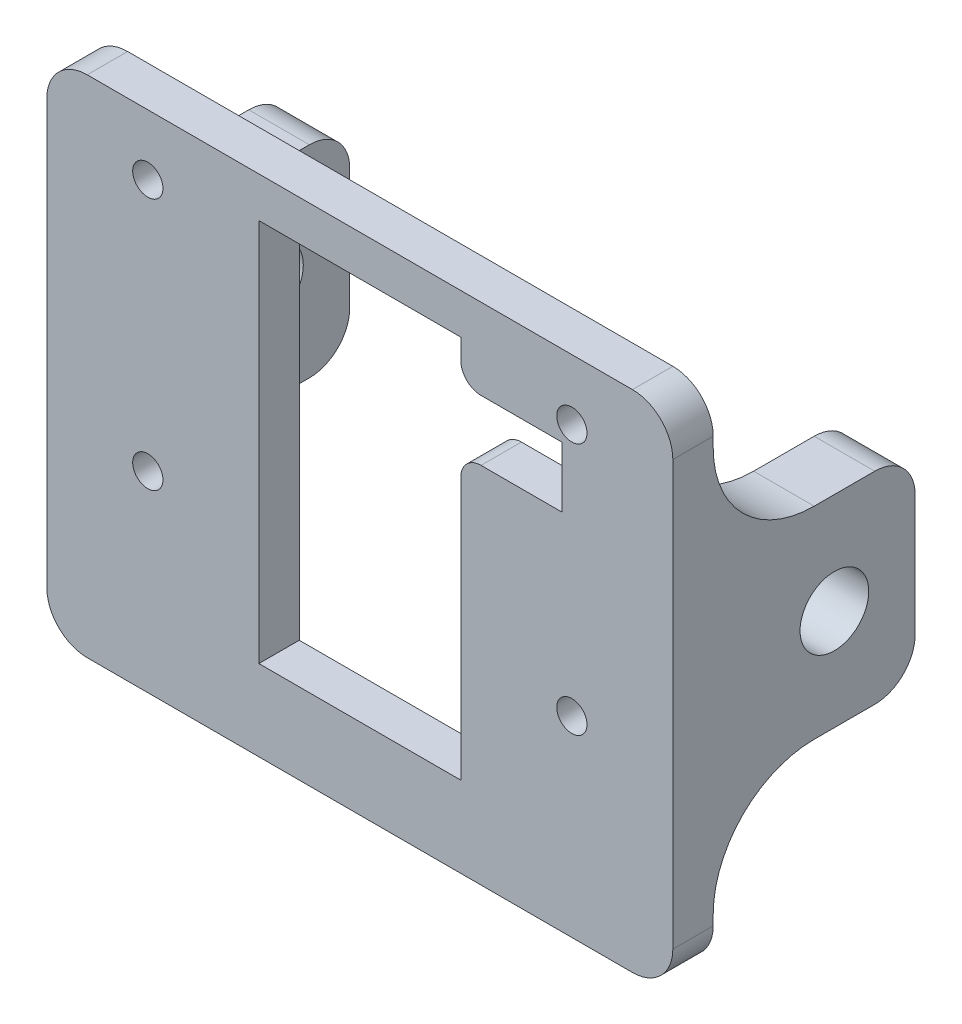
from build123d import *

# Parameters (mm, degrees)
ESQUISSE1_W             = 31
ESQUISSE1_H             = 25
BOSS_EXTRU_1_DEPTH      = 2
ENL_V_MAT_EXTRU_1_REACH = 22.012
ESQUISSE2_R             = 0.75
ENL_V_MAT_EXTRU_2_REACH = 22.012
ESQUISSE3_W             = 10
ESQUISSE3_H             = 19
ENL_V_MAT_EXTRU_3_REACH = 22.012
ESQUISSE6_W             = 5
ESQUISSE6_H             = 3
ESQUISSE7_W             = 3
ESQUISSE7_H             = 10
BOSS_EXTRU_2_DEPTH      = 10
CONG_1_R                = 5
CONG_2_R                = 2
ESQUISSE8_R             = 1.7
ENL_V_MAT_EXTRU_4_DEPTH = 35.889110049
CONG_3_R                = 2
CONG_4_R                = 1


with BuildPart() as part:
    # Esquisse1 → Boss.-Extru.1 (new body)
    with BuildSketch(Plane.XY):
        Rectangle(ESQUISSE1_W, ESQUISSE1_H)
    extrude(amount=BOSS_EXTRU_1_DEPTH)

    # Esquisse2 → Enl_v. mat.-Extru.1 (cut, up to next)
    with BuildSketch(Plane.XY.offset(2), mode=Mode.PRIVATE) as enl_v_mat_extru_1_sk1:
        with Locations((-10.5, 9.5)):
            Circle(ESQUISSE2_R)
    enl_v_mat_extru_1_tool1 = extrude(enl_v_mat_extru_1_sk1.sketch, amount=-ENL_V_MAT_EXTRU_1_REACH, mode=Mode.PRIVATE) & part.part
    # Esquisse2 → Enl_v. mat.-Extru.1 (cut, up to next)
    with BuildSketch(Plane.XY.offset(2), mode=Mode.PRIVATE) as enl_v_mat_extru_1_sk2:
        with Locations((-10.5, -3)):
            Circle(ESQUISSE2_R)
    enl_v_mat_extru_1_tool2 = extrude(enl_v_mat_extru_1_sk2.sketch, amount=-ENL_V_MAT_EXTRU_1_REACH, mode=Mode.PRIVATE) & part.part
    # Esquisse2 → Enl_v. mat.-Extru.1 (cut, up to next)
    with BuildSketch(Plane.XY.offset(2), mode=Mode.PRIVATE) as enl_v_mat_extru_1_sk3:
        with Locations((10.5, -3)):
            Circle(ESQUISSE2_R)
    enl_v_mat_extru_1_tool3 = extrude(enl_v_mat_extru_1_sk3.sketch, amount=-ENL_V_MAT_EXTRU_1_REACH, mode=Mode.PRIVATE) & part.part
    # Esquisse2 → Enl_v. mat.-Extru.1 (cut, up to next)
    with BuildSketch(Plane.XY.offset(2), mode=Mode.PRIVATE) as enl_v_mat_extru_1_sk4:
        with Locations((10.5, 9.5)):
            Circle(ESQUISSE2_R)
    enl_v_mat_extru_1_tool4 = extrude(enl_v_mat_extru_1_sk4.sketch, amount=-ENL_V_MAT_EXTRU_1_REACH, mode=Mode.PRIVATE) & part.part
    add(enl_v_mat_extru_1_tool1.solids().sort_by_distance((-10.5, 9.5, 2))[0], mode=Mode.SUBTRACT)
    add(enl_v_mat_extru_1_tool2.solids().sort_by_distance((-10.5, -3, 2))[0], mode=Mode.SUBTRACT)
    add(enl_v_mat_extru_1_tool3.solids().sort_by_distance((10.5, -3, 2))[0], mode=Mode.SUBTRACT)
    add(enl_v_mat_extru_1_tool4.solids().sort_by_distance((10.5, 9.5, 2))[0], mode=Mode.SUBTRACT)

    # Esquisse3 → Enl_v. mat.-Extru.2 (cut, up to next)
    with BuildSketch(Plane.XY.offset(2), mode=Mode.PRIVATE) as enl_v_mat_extru_2_sk1:
        with Locations((0, 1)):
            Rectangle(ESQUISSE3_W, ESQUISSE3_H)
    enl_v_mat_extru_2_tool1 = extrude(enl_v_mat_extru_2_sk1.sketch, amount=-ENL_V_MAT_EXTRU_2_REACH, mode=Mode.PRIVATE) & part.part
    add(enl_v_mat_extru_2_tool1.solids().sort_by_distance((0, 1, 2))[0], mode=Mode.SUBTRACT)

    # Esquisse6 → Enl_v. mat.-Extru.3 (cut, up to next)
    with BuildSketch(Plane.XY.offset(2), mode=Mode.PRIVATE) as enl_v_mat_extru_3_sk1:
        with Locations((7.5, 7)):
            Rectangle(ESQUISSE6_W, ESQUISSE6_H)
    enl_v_mat_extru_3_tool1 = extrude(enl_v_mat_extru_3_sk1.sketch, amount=-ENL_V_MAT_EXTRU_3_REACH, mode=Mode.PRIVATE) & part.part
    add(enl_v_mat_extru_3_tool1.solids().sort_by_distance((7.5, 7, 2))[0], mode=Mode.SUBTRACT)

    # Esquisse7 → Boss.-Extru.2 (add)
    with BuildSketch(Plane(origin=(0, 0, 0), x_dir=(-1, 0, 0), z_dir=(0, 0, -1))):
        with Locations((14, 0)):
            Rectangle(ESQUISSE7_W, ESQUISSE7_H)
        with Locations((-14, 0)):
            Rectangle(ESQUISSE7_W, ESQUISSE7_H)
    extrude(amount=BOSS_EXTRU_2_DEPTH)

    # Cong_1
    cong_1_edges = [part.edges().sort_by_distance(p)[0] for p in [
        (-14, 5, 0),
        (-14, -5, 0),
        (14, -5, 0),
        (14, 5, 0),
    ]]
    fillet(cong_1_edges, radius=CONG_1_R)

    # Cong_2
    cong_2_edges = [part.edges().sort_by_distance(p)[0] for p in [
        (-14, 5, -10),
        (-14, -5, -10),
        (14, -5, -10),
        (14, 5, -10),
    ]]
    fillet(cong_2_edges, radius=CONG_2_R)

    # Esquisse8 → Enl_v. mat.-Extru.4 (cut, through all)
    with BuildSketch(Plane(origin=(15.5, 0, 0), x_dir=(0, 0, -1), z_dir=(1, 0, 0))):
        with Locations(Location((6, 0, 0), (0, 0, 90))):
            Circle(ESQUISSE8_R)
    extrude(amount=-ENL_V_MAT_EXTRU_4_DEPTH, mode=Mode.SUBTRACT)

    # Cong_3
    cong_3_edges = [part.edges().sort_by_distance(p)[0] for p in [
        (-15.5, 12.5, 1),
        (15.5, 12.5, 1),
        (15.5, -12.5, 1),
        (-15.5, -12.5, 1),
    ]]
    fillet(cong_3_edges, radius=CONG_3_R)

    # Cong_4
    cong_4_edges = [part.edges().sort_by_distance(p)[0] for p in [
        (5, 5.5, 1),
        (5, 8.5, 1),
    ]]
    fillet(cong_4_edges, radius=CONG_4_R)


solid = part.part
